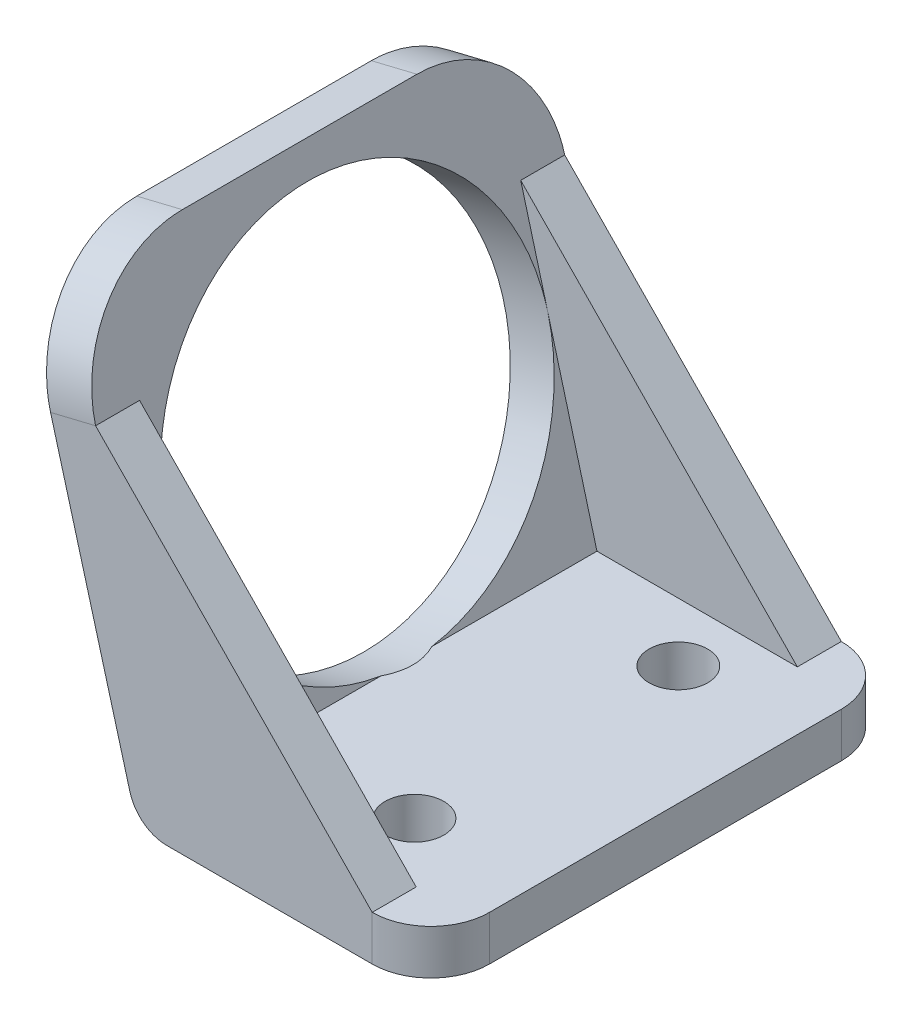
from build123d import *

# Parameters (mm, degrees)
EXTRUDE_1_DEPTH     = 16
SKETCH_2_R          = 6.5
CUT_EXTRUDE_1_DEPTH = 22
FILLET_3_R          = 2
FILLET_4_R          = 1.3
FILLET_5_R          = 4
RIB_1_REACH         = 26.807
SKETCH_14_WALL_W    = 65.113819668
SKETCH_14_WALL_H    = 1.5
RIB_2_REACH         = 26.807
SKETCH_17_WALL_W    = 65.113819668
SKETCH_17_WALL_H    = 1.5
SKETCH_18_R         = 1
CUT_EXTRUDE_2_DEPTH = 10


with BuildPart() as part:
    # Sketch 1 → Extrude 1 (new body)
    with BuildSketch(Plane.XY):
        Polygon((-7.504024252, 0), (2.495975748, 0), (2.495975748, 1.527150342), (-6.338684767, 1.527150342), (-9.979219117, 15.045527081), (-11.534050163, 14.668034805), align=None)
    extrude(amount=EXTRUDE_1_DEPTH)

    # Sketch 2 → Cut-Extrude 1 (cut)
    with BuildSketch(Plane(origin=(-6.977327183, -1.917012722, 0), x_dir=(0, 0, 1), z_dir=(-0.9642672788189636, -0.26493134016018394, 0))):
        with Locations(Location((8, 9.593844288, 0), (0, 0, 270))):
            Circle(SKETCH_2_R)
    extrude(amount=-CUT_EXTRUDE_1_DEPTH, mode=Mode.SUBTRACT)

    # Fillet 3
    fillet_3_edges = [part.edges().sort_by_distance(p)[0] for p in [
        (2.495975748, 0.763575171, 16),
        (2.495975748, 0.763575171, 0),
    ]]
    fillet(fillet_3_edges, radius=FILLET_3_R)

    # Fillet 4
    fillet_4_edges = [part.edges().sort_by_distance(p)[0] for p in [
        (-7.504024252, 0, 8),
    ]]
    fillet(fillet_4_edges, radius=FILLET_4_R)

    # Fillet 5
    fillet_5_edges = [part.edges().sort_by_distance(p)[0] for p in [
        (-10.75663464, 14.856780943, 16),
        (-10.75663464, 14.856780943, 0),
    ]]
    fillet(fillet_5_edges, radius=FILLET_5_R)

    # Sketch 14 wall → Rib 1 (add, up to next)
    with BuildSketch(Plane(origin=(-4.221384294, 6.354543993, 0), x_dir=(0.698908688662, -0.715210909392, 0), z_dir=(-0.715210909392, -0.698908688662, 0)), mode=Mode.PRIVATE) as rib_1_sk1:
        with Locations((0, 0.75)):
            Rectangle(SKETCH_14_WALL_W, SKETCH_14_WALL_H)
    rib_1_tool1 = extrude(rib_1_sk1.sketch, amount=RIB_1_REACH, mode=Mode.PRIVATE) - part.part
    add(rib_1_tool1.solids().sort_by_distance((-4.221384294, 6.354543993, 0))[0])

    # Sketch 17 wall → Rib 2 (add, up to next)
    with BuildSketch(Plane(origin=(-4.221384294, 6.354543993, 16), x_dir=(0.698908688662, -0.715210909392, 0), z_dir=(0.715210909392, 0.698908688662, 0)), mode=Mode.PRIVATE) as rib_2_sk1:
        with Locations((0, 0.75)):
            Rectangle(SKETCH_17_WALL_W, SKETCH_17_WALL_H)
    rib_2_tool1 = extrude(rib_2_sk1.sketch, amount=-RIB_2_REACH, mode=Mode.PRIVATE) - part.part
    add(rib_2_tool1.solids().sort_by_distance((-4.221384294, 6.354543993, 16))[0])

    # Sketch 18 → Cut-Extrude 2 (cut)
    with BuildSketch(Plane(origin=(0, 1.527150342, 0), x_dir=(1, 0, 0), z_dir=(0, 1, 0))):
        with Locations(Location((-1.562919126, -12.5, 0), (0, 0, 270))):
            Circle(SKETCH_18_R)
        with Locations(Location((-1.562919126, -3.5, 0), (0, 0, 270))):
            Circle(SKETCH_18_R)
    extrude(amount=-CUT_EXTRUDE_2_DEPTH, mode=Mode.SUBTRACT)


solid = part.part
